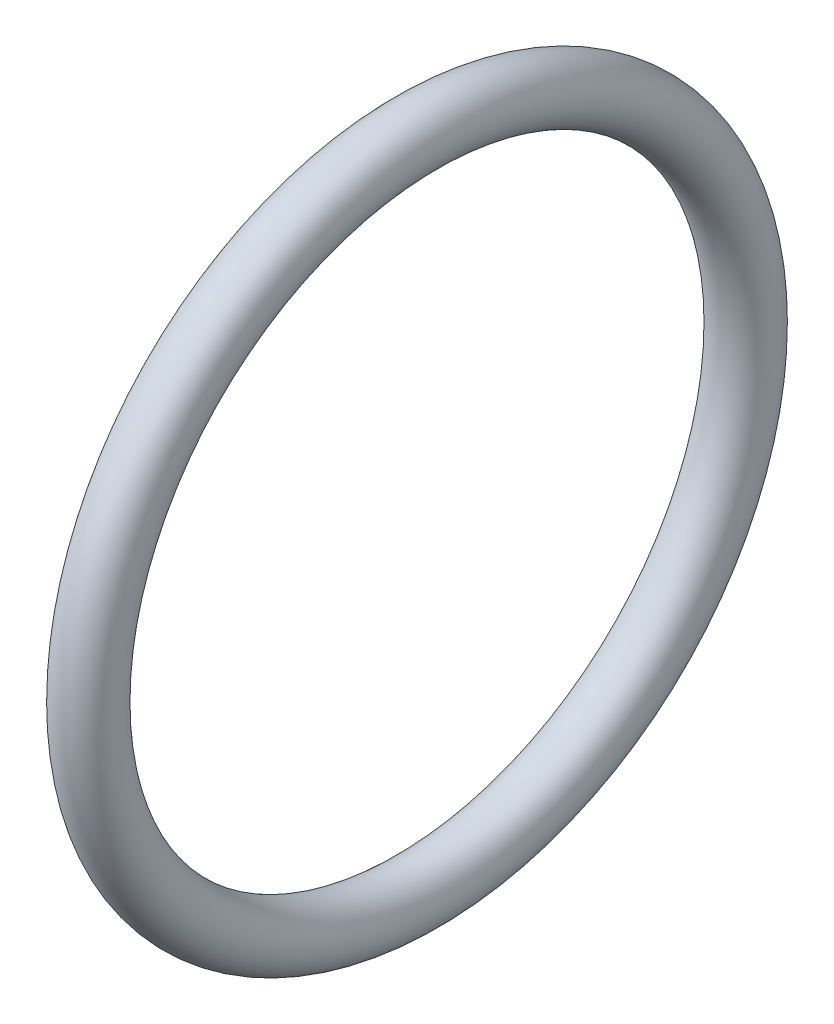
from build123d import *

# Parameters (mm, degrees)
ESQUISSE1_R = 1.75


with BuildPart() as part:
    # Esquisse1 → Base-R_volution (revolve)
    with BuildSketch(Plane.XY, mode=Mode.PRIVATE) as base_r_volution_sk:
        with Locations((0, 19.5)):
            Circle(ESQUISSE1_R)
    revolve(base_r_volution_sk.sketch.rotate(Axis((-50, 0, 0), (1, 0, 0)), 90), axis=Axis((-50, 0, 0), (1, 0, 0)))


solid = part.part
